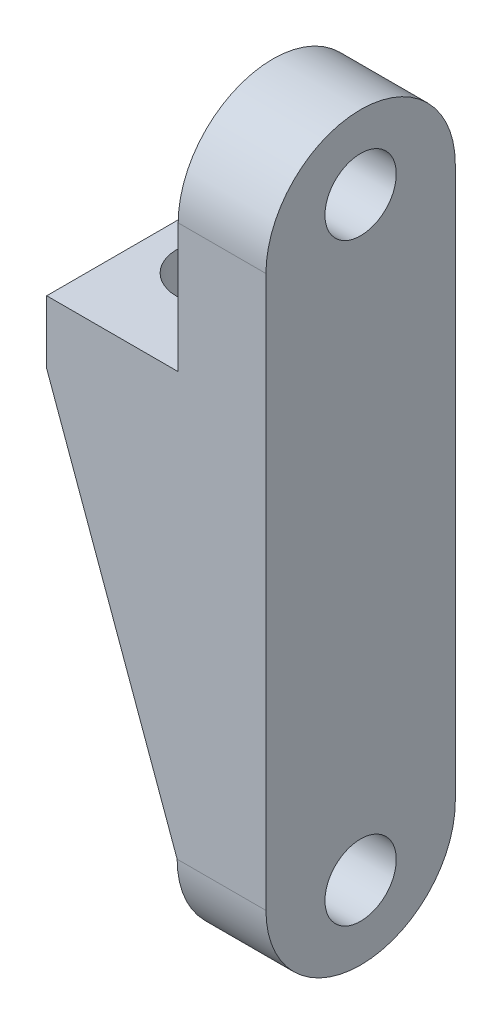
from build123d import *

# Parameters (mm, degrees)
BOSS_EXTRUDE1_DEPTH          = 5.715
F_18_0_1695_DIAMETER_HOLE1_D = 4.3053
F_10_0_1935_DIAMETER_HOLE1_D = 4.9149
FILLET3_RADIUS               = 5.715
FILLET3_LENGTH               = 5.36067
FILLET4_RADIUS               = 5.715
FILLET4_LENGTH               = 5.29717
BOSS_EXTRUDE4_DEPTH          = 1.27


with BuildPart() as part:
    # Sketch1 → Boss-Extrude1 (new, symmetric)
    with BuildSketch(Plane.XY):
        Polygon((0, 0), (-7.9375, 0), (-7.9375, -3.81), (-0.0635, -3.81), (-0.0635, -31.23311), (5.29717, -31.23311), (5.29717, 13.49375), (0, 13.49375), align=None)
    extrude(amount=BOSS_EXTRUDE1_DEPTH, both=True)

    # 18 _0.1695_ Diameter Hole1 (through all)
    with Locations(Plane.ZY.offset(0.0635)):
        with Locations((0, -26.78811), (0, 9.04875)):
            Hole(F_18_0_1695_DIAMETER_HOLE1_D / 2)

    # 10 _0.1935_ Diameter Hole1 (through all)
    with Locations(Plane(origin=(0, -3.81, 0), x_dir=(-1, 0, 0), z_dir=(0, -1, 0))):
        with Locations((3.96875, 0.635)):
            Hole(F_10_0_1935_DIAMETER_HOLE1_D / 2)

    # Fillet3: full round fillet: the end face becomes a half cylinder, R = half its width
    fillet3_face = Plane((2.616835, -31.23311, 0), x_dir=(-1, 0, 0), z_dir=(0, -1, 0))  # on the end face: x along it, z out of the body
    fillet3_slab = fillet3_face.offset(-FILLET3_RADIUS / 2) * Box(FILLET3_LENGTH, 2 * FILLET3_RADIUS, FILLET3_RADIUS, mode=Mode.PRIVATE)  # the body's end, R deep
    fillet3_round = Plane((2.616835, -25.51811, 0), x_dir=(0, -1, 0), z_dir=(-1, 0, 0)) * Cylinder(FILLET3_RADIUS, FILLET3_LENGTH, mode=Mode.PRIVATE)  # its axis R under the face
    add(fillet3_slab - fillet3_round, mode=Mode.SUBTRACT)

    # Fillet4: full round fillet: the end face becomes a half cylinder, R = half its width
    fillet4_face = Plane((2.648585, 13.49375, 0), x_dir=(1, 0, 0), z_dir=(0, 1, 0))  # on the end face: x along it, z out of the body
    fillet4_slab = fillet4_face.offset(-FILLET4_RADIUS / 2) * Box(FILLET4_LENGTH, 2 * FILLET4_RADIUS, FILLET4_RADIUS, mode=Mode.PRIVATE)  # the body's end, R deep
    fillet4_round = Plane((2.648585, 7.77875, 0), x_dir=(0, 1, 0), z_dir=(1, 0, 0)) * Cylinder(FILLET4_RADIUS, FILLET4_LENGTH, mode=Mode.PRIVATE)  # its axis R under the face
    add(fillet4_slab - fillet4_round, mode=Mode.SUBTRACT)

    # Sketch9 → Boss-Extrude4 (add)
    with BuildSketch(Plane(origin=(0, 0, -5.715), x_dir=(-1, 0, 0), z_dir=(0, 0, -1))):
        Polygon((7.9375, 0), (7.9375, -3.81), (0.0635, -25.51811), (-5.29717, -25.51811), (-5.29717, 0), align=None)
    boss_extrude4 = extrude(amount=-BOSS_EXTRUDE4_DEPTH)

    # Mirror3: Boss-Extrude4 across plane
    add(boss_extrude4.mirror(Plane.XY))


solid = part.part
